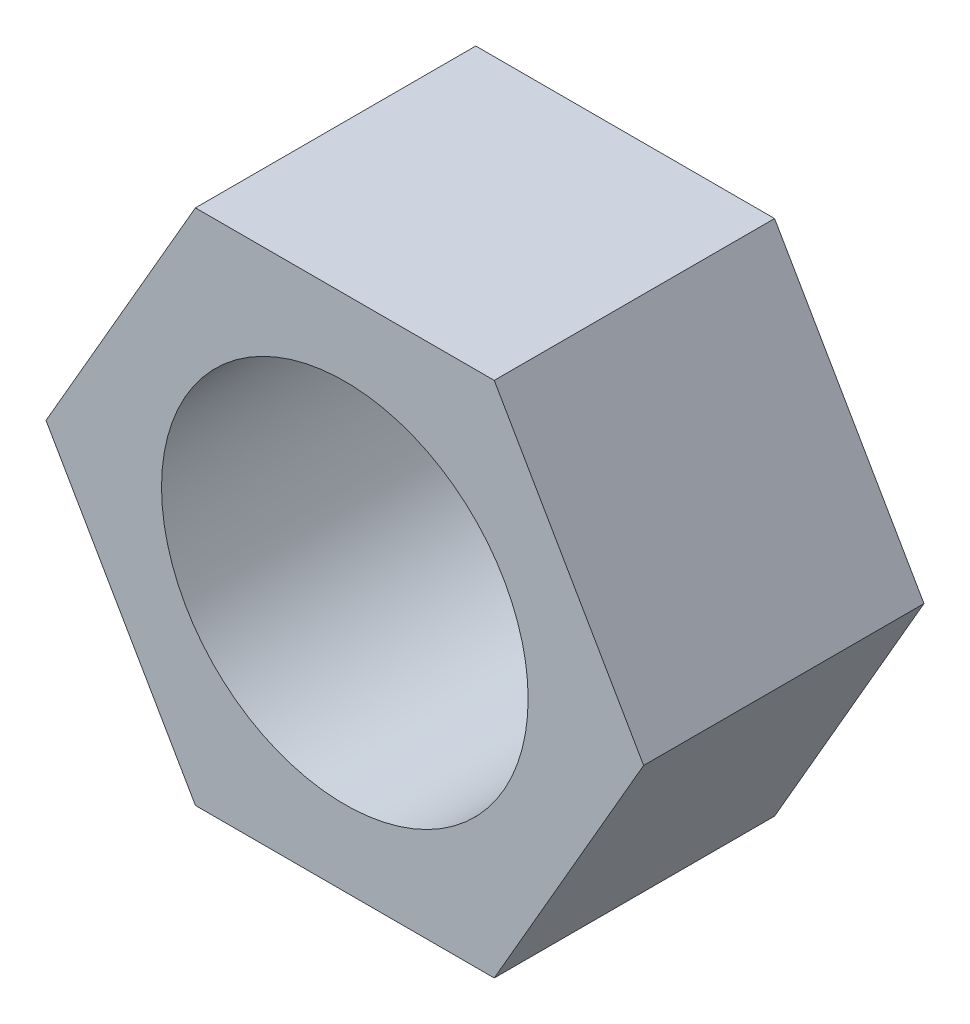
ISO-10303-21;
HEADER;
FILE_DESCRIPTION(('STEP AP214'),'2;1');
FILE_NAME('part.step','',(''),(''),'','','');
FILE_SCHEMA(('AUTOMOTIVE_DESIGN { 1 0 10303 214 1 1 1 1 }'));
ENDSEC;
DATA;
#1=APPLICATION_CONTEXT('core data for automotive mechanical design processes');
#2=APPLICATION_PROTOCOL_DEFINITION('international standard','automotive_design',2000,#1);
#3=PRODUCT_CONTEXT('',#1,'mechanical');
#4=PRODUCT('Part','Part','',(#3));
#5=PRODUCT_RELATED_PRODUCT_CATEGORY('part','',(#4));
#6=PRODUCT_DEFINITION_FORMATION('','',#4);
#7=PRODUCT_DEFINITION_CONTEXT('part definition',#1,'design');
#8=PRODUCT_DEFINITION('design','',#6,#7);
#9=PRODUCT_DEFINITION_SHAPE('','',#8);
#10=(LENGTH_UNIT() NAMED_UNIT(*) SI_UNIT(.MILLI.,.METRE.));
#11=(NAMED_UNIT(*) PLANE_ANGLE_UNIT() SI_UNIT($,.RADIAN.));
#12=(NAMED_UNIT(*) SI_UNIT($,.STERADIAN.) SOLID_ANGLE_UNIT());
#13=UNCERTAINTY_MEASURE_WITH_UNIT(LENGTH_MEASURE(1.E-05),#10,'distance_accuracy_value','');
#14=(GEOMETRIC_REPRESENTATION_CONTEXT(3) GLOBAL_UNCERTAINTY_ASSIGNED_CONTEXT((#13)) GLOBAL_UNIT_ASSIGNED_CONTEXT((#10,
#11,#12)) REPRESENTATION_CONTEXT('',''));
#15=CARTESIAN_POINT('',(0.,0.,0.));
#16=DIRECTION('',(0.,0.,1.));
#17=DIRECTION('',(1.,0.,0.));
#18=AXIS2_PLACEMENT_3D('',#15,#16,#17);
#19=CARTESIAN_POINT('',(0.,0.,13.));
#20=DIRECTION('',(0.,0.,1.));
#21=DIRECTION('',(1.,0.,0.));
#22=AXIS2_PLACEMENT_3D('',#19,#20,#21);
#23=PLANE('',#22);
#24=CARTESIAN_POINT('',(0.,0.,13.));
#25=DIRECTION('',(0.,0.,1.));
#26=DIRECTION('',(1.,0.,0.));
#27=AXIS2_PLACEMENT_3D('',#24,#25,#26);
#28=CIRCLE('',#27,8.5);
#29=CARTESIAN_POINT('',(8.5,0.,13.));
#30=VERTEX_POINT('',#29);
#31=EDGE_CURVE('E25',#30,#30,#28,.T.);
#32=ORIENTED_EDGE('',*,*,#31,.F.);
#33=EDGE_LOOP('',(#32));
#34=FACE_BOUND('',#33,.T.);
#35=DIRECTION('',(-0.500000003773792,0.866025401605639,0.));
#36=VECTOR('',#35,1.);
#37=CARTESIAN_POINT('',(13.8564065,0.,13.));
#38=LINE('',#37,#36);
#39=CARTESIAN_POINT('',(13.8564065,0.,13.));
#40=VERTEX_POINT('',#39);
#41=CARTESIAN_POINT('',(6.9282032,12.,13.));
#42=VERTEX_POINT('',#41);
#43=EDGE_CURVE('E221',#40,#42,#38,.T.);
#44=ORIENTED_EDGE('',*,*,#43,.T.);
#45=DIRECTION('',(-1.,0.,0.));
#46=VECTOR('',#45,1.);
#47=CARTESIAN_POINT('',(6.9282032,12.,13.));
#48=LINE('',#47,#46);
#49=CARTESIAN_POINT('',(-6.9282032,12.,13.));
#50=VERTEX_POINT('',#49);
#51=EDGE_CURVE('E242',#42,#50,#48,.T.);
#52=ORIENTED_EDGE('',*,*,#51,.T.);
#53=DIRECTION('',(-0.500000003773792,-0.866025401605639,0.));
#54=VECTOR('',#53,1.);
#55=CARTESIAN_POINT('',(-6.9282032,12.,13.));
#56=LINE('',#55,#54);
#57=CARTESIAN_POINT('',(-13.8564065,0.,13.));
#58=VERTEX_POINT('',#57);
#59=EDGE_CURVE('E104',#50,#58,#56,.T.);
#60=ORIENTED_EDGE('',*,*,#59,.T.);
#61=DIRECTION('',(0.500000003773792,-0.866025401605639,0.));
#62=VECTOR('',#61,1.);
#63=CARTESIAN_POINT('',(-13.8564065,0.,13.));
#64=LINE('',#63,#62);
#65=CARTESIAN_POINT('',(-6.9282032,-12.,13.));
#66=VERTEX_POINT('',#65);
#67=EDGE_CURVE('E101',#58,#66,#64,.T.);
#68=ORIENTED_EDGE('',*,*,#67,.T.);
#69=DIRECTION('',(1.,0.,0.));
#70=VECTOR('',#69,1.);
#71=CARTESIAN_POINT('',(-6.9282032,-12.,13.));
#72=LINE('',#71,#70);
#73=CARTESIAN_POINT('',(6.9282032,-12.,13.));
#74=VERTEX_POINT('',#73);
#75=EDGE_CURVE('E87',#66,#74,#72,.T.);
#76=ORIENTED_EDGE('',*,*,#75,.T.);
#77=DIRECTION('',(0.500000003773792,0.866025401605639,0.));
#78=VECTOR('',#77,1.);
#79=CARTESIAN_POINT('',(6.9282032,-12.,13.));
#80=LINE('',#79,#78);
#81=EDGE_CURVE('E126',#74,#40,#80,.T.);
#82=ORIENTED_EDGE('',*,*,#81,.T.);
#83=EDGE_LOOP('',(#44,#52,#60,#68,#76,#82));
#84=FACE_BOUND('',#83,.T.);
#85=ADVANCED_FACE('F16',(#34,#84),#23,.T.);
#86=CARTESIAN_POINT('',(0.,0.,0.));
#87=DIRECTION('',(0.,0.,1.));
#88=DIRECTION('',(1.,0.,0.));
#89=AXIS2_PLACEMENT_3D('',#86,#87,#88);
#90=PLANE('',#89);
#91=CARTESIAN_POINT('',(0.,0.,0.));
#92=DIRECTION('',(0.,0.,1.));
#93=DIRECTION('',(1.,0.,0.));
#94=AXIS2_PLACEMENT_3D('',#91,#92,#93);
#95=CIRCLE('',#94,8.5);
#96=CARTESIAN_POINT('',(8.5,0.,0.));
#97=VERTEX_POINT('',#96);
#98=EDGE_CURVE('E10',#97,#97,#95,.T.);
#99=ORIENTED_EDGE('',*,*,#98,.T.);
#100=EDGE_LOOP('',(#99));
#101=FACE_BOUND('',#100,.T.);
#102=DIRECTION('',(0.500000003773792,0.866025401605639,0.));
#103=VECTOR('',#102,1.);
#104=CARTESIAN_POINT('',(6.9282032,-12.,0.));
#105=LINE('',#104,#103);
#106=CARTESIAN_POINT('',(6.9282032,-12.,0.));
#107=VERTEX_POINT('',#106);
#108=CARTESIAN_POINT('',(13.8564065,0.,0.));
#109=VERTEX_POINT('',#108);
#110=EDGE_CURVE('E98',#107,#109,#105,.T.);
#111=ORIENTED_EDGE('',*,*,#110,.F.);
#112=DIRECTION('',(1.,0.,0.));
#113=VECTOR('',#112,1.);
#114=CARTESIAN_POINT('',(-6.9282032,-12.,0.));
#115=LINE('',#114,#113);
#116=CARTESIAN_POINT('',(-6.9282032,-12.,0.));
#117=VERTEX_POINT('',#116);
#118=EDGE_CURVE('E109',#117,#107,#115,.T.);
#119=ORIENTED_EDGE('',*,*,#118,.F.);
#120=DIRECTION('',(0.500000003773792,-0.866025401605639,0.));
#121=VECTOR('',#120,1.);
#122=CARTESIAN_POINT('',(-13.8564065,0.,0.));
#123=LINE('',#122,#121);
#124=CARTESIAN_POINT('',(-13.8564065,0.,0.));
#125=VERTEX_POINT('',#124);
#126=EDGE_CURVE('E112',#125,#117,#123,.T.);
#127=ORIENTED_EDGE('',*,*,#126,.F.);
#128=DIRECTION('',(-0.500000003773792,-0.866025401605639,0.));
#129=VECTOR('',#128,1.);
#130=CARTESIAN_POINT('',(-6.9282032,12.,0.));
#131=LINE('',#130,#129);
#132=CARTESIAN_POINT('',(-6.9282032,12.,0.));
#133=VERTEX_POINT('',#132);
#134=EDGE_CURVE('E245',#133,#125,#131,.T.);
#135=ORIENTED_EDGE('',*,*,#134,.F.);
#136=DIRECTION('',(-1.,0.,0.));
#137=VECTOR('',#136,1.);
#138=CARTESIAN_POINT('',(6.9282032,12.,0.));
#139=LINE('',#138,#137);
#140=CARTESIAN_POINT('',(6.9282032,12.,0.));
#141=VERTEX_POINT('',#140);
#142=EDGE_CURVE('E223',#141,#133,#139,.T.);
#143=ORIENTED_EDGE('',*,*,#142,.F.);
#144=DIRECTION('',(-0.500000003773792,0.866025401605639,0.));
#145=VECTOR('',#144,1.);
#146=CARTESIAN_POINT('',(13.8564065,0.,0.));
#147=LINE('',#146,#145);
#148=EDGE_CURVE('E220',#109,#141,#147,.T.);
#149=ORIENTED_EDGE('',*,*,#148,.F.);
#150=EDGE_LOOP('',(#111,#119,#127,#135,#143,#149));
#151=FACE_BOUND('',#150,.T.);
#152=ADVANCED_FACE('F194',(#101,#151),#90,.F.);
#153=CARTESIAN_POINT('',(0.,0.,0.));
#154=DIRECTION('',(0.,0.,-1.));
#155=DIRECTION('',(1.,0.,0.));
#156=AXIS2_PLACEMENT_3D('',#153,#154,#155);
#157=CYLINDRICAL_SURFACE('',#156,8.5);
#158=DIRECTION('',(0.,0.,1.));
#159=VECTOR('',#158,1.);
#160=CARTESIAN_POINT('',(8.5,0.,0.));
#161=LINE('',#160,#159);
#162=EDGE_CURVE('E129',#97,#30,#161,.T.);
#163=ORIENTED_EDGE('',*,*,#162,.T.);
#164=ORIENTED_EDGE('',*,*,#31,.T.);
#165=ORIENTED_EDGE('',*,*,#162,.F.);
#166=ORIENTED_EDGE('',*,*,#98,.F.);
#167=EDGE_LOOP('',(#163,#164,#165,#166));
#168=FACE_BOUND('',#167,.T.);
#169=ADVANCED_FACE('F185',(#168),#157,.F.);
#170=CARTESIAN_POINT('',(6.9282032,-12.,0.));
#171=DIRECTION('',(-0.866025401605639,0.500000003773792,0.));
#172=DIRECTION('',(0.,0.,1.));
#173=AXIS2_PLACEMENT_3D('',#170,#171,#172);
#174=PLANE('',#173);
#175=ORIENTED_EDGE('',*,*,#110,.T.);
#176=DIRECTION('',(0.,0.,1.));
#177=VECTOR('',#176,1.);
#178=CARTESIAN_POINT('',(13.8564065,0.,0.));
#179=LINE('',#178,#177);
#180=EDGE_CURVE('E214',#109,#40,#179,.T.);
#181=ORIENTED_EDGE('',*,*,#180,.T.);
#182=ORIENTED_EDGE('',*,*,#81,.F.);
#183=DIRECTION('',(0.,0.,1.));
#184=VECTOR('',#183,1.);
#185=CARTESIAN_POINT('',(6.9282032,-12.,0.));
#186=LINE('',#185,#184);
#187=EDGE_CURVE('E95',#107,#74,#186,.T.);
#188=ORIENTED_EDGE('',*,*,#187,.F.);
#189=EDGE_LOOP('',(#175,#181,#182,#188));
#190=FACE_BOUND('',#189,.T.);
#191=ADVANCED_FACE('F142',(#190),#174,.F.);
#192=CARTESIAN_POINT('',(-6.9282032,-12.,0.));
#193=DIRECTION('',(0.,1.,0.));
#194=DIRECTION('',(1.,0.,0.));
#195=AXIS2_PLACEMENT_3D('',#192,#193,#194);
#196=PLANE('',#195);
#197=ORIENTED_EDGE('',*,*,#118,.T.);
#198=ORIENTED_EDGE('',*,*,#187,.T.);
#199=ORIENTED_EDGE('',*,*,#75,.F.);
#200=DIRECTION('',(0.,0.,1.));
#201=VECTOR('',#200,1.);
#202=CARTESIAN_POINT('',(-6.9282032,-12.,0.));
#203=LINE('',#202,#201);
#204=EDGE_CURVE('E92',#117,#66,#203,.T.);
#205=ORIENTED_EDGE('',*,*,#204,.F.);
#206=EDGE_LOOP('',(#197,#198,#199,#205));
#207=FACE_BOUND('',#206,.T.);
#208=ADVANCED_FACE('F90',(#207),#196,.F.);
#209=CARTESIAN_POINT('',(-13.8564065,0.,0.));
#210=DIRECTION('',(0.866025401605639,0.500000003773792,0.));
#211=DIRECTION('',(0.,0.,-1.));
#212=AXIS2_PLACEMENT_3D('',#209,#210,#211);
#213=PLANE('',#212);
#214=ORIENTED_EDGE('',*,*,#126,.T.);
#215=ORIENTED_EDGE('',*,*,#204,.T.);
#216=ORIENTED_EDGE('',*,*,#67,.F.);
#217=DIRECTION('',(0.,0.,1.));
#218=VECTOR('',#217,1.);
#219=CARTESIAN_POINT('',(-13.8564065,0.,0.));
#220=LINE('',#219,#218);
#221=EDGE_CURVE('E246',#125,#58,#220,.T.);
#222=ORIENTED_EDGE('',*,*,#221,.F.);
#223=EDGE_LOOP('',(#214,#215,#216,#222));
#224=FACE_BOUND('',#223,.T.);
#225=ADVANCED_FACE('F111',(#224),#213,.F.);
#226=CARTESIAN_POINT('',(-6.9282032,12.,0.));
#227=DIRECTION('',(0.866025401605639,-0.500000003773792,0.));
#228=DIRECTION('',(0.,0.,-1.));
#229=AXIS2_PLACEMENT_3D('',#226,#227,#228);
#230=PLANE('',#229);
#231=ORIENTED_EDGE('',*,*,#134,.T.);
#232=ORIENTED_EDGE('',*,*,#221,.T.);
#233=ORIENTED_EDGE('',*,*,#59,.F.);
#234=DIRECTION('',(0.,0.,1.));
#235=VECTOR('',#234,1.);
#236=CARTESIAN_POINT('',(-6.9282032,12.,0.));
#237=LINE('',#236,#235);
#238=EDGE_CURVE('E238',#133,#50,#237,.T.);
#239=ORIENTED_EDGE('',*,*,#238,.F.);
#240=EDGE_LOOP('',(#231,#232,#233,#239));
#241=FACE_BOUND('',#240,.T.);
#242=ADVANCED_FACE('F163',(#241),#230,.F.);
#243=CARTESIAN_POINT('',(6.9282032,12.,0.));
#244=DIRECTION('',(0.,-1.,0.));
#245=DIRECTION('',(0.,0.,-1.));
#246=AXIS2_PLACEMENT_3D('',#243,#244,#245);
#247=PLANE('',#246);
#248=ORIENTED_EDGE('',*,*,#142,.T.);
#249=ORIENTED_EDGE('',*,*,#238,.T.);
#250=ORIENTED_EDGE('',*,*,#51,.F.);
#251=DIRECTION('',(0.,0.,1.));
#252=VECTOR('',#251,1.);
#253=CARTESIAN_POINT('',(6.9282032,12.,0.));
#254=LINE('',#253,#252);
#255=EDGE_CURVE('E228',#141,#42,#254,.T.);
#256=ORIENTED_EDGE('',*,*,#255,.F.);
#257=EDGE_LOOP('',(#248,#249,#250,#256));
#258=FACE_BOUND('',#257,.T.);
#259=ADVANCED_FACE('F154',(#258),#247,.F.);
#260=CARTESIAN_POINT('',(13.8564065,0.,0.));
#261=DIRECTION('',(-0.866025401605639,-0.500000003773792,0.));
#262=DIRECTION('',(-0.500000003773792,0.866025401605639,0.));
#263=AXIS2_PLACEMENT_3D('',#260,#261,#262);
#264=PLANE('',#263);
#265=ORIENTED_EDGE('',*,*,#148,.T.);
#266=ORIENTED_EDGE('',*,*,#255,.T.);
#267=ORIENTED_EDGE('',*,*,#43,.F.);
#268=ORIENTED_EDGE('',*,*,#180,.F.);
#269=EDGE_LOOP('',(#265,#266,#267,#268));
#270=FACE_BOUND('',#269,.T.);
#271=ADVANCED_FACE('F149',(#270),#264,.F.);
#272=CLOSED_SHELL('',(#85,#152,#169,#191,#208,#225,#242,#259,#271));
#273=MANIFOLD_SOLID_BREP('B1',#272);
#274=ADVANCED_BREP_SHAPE_REPRESENTATION('',(#18,#273),#14);
#275=SHAPE_DEFINITION_REPRESENTATION(#9,#274);
ENDSEC;
END-ISO-10303-21;
